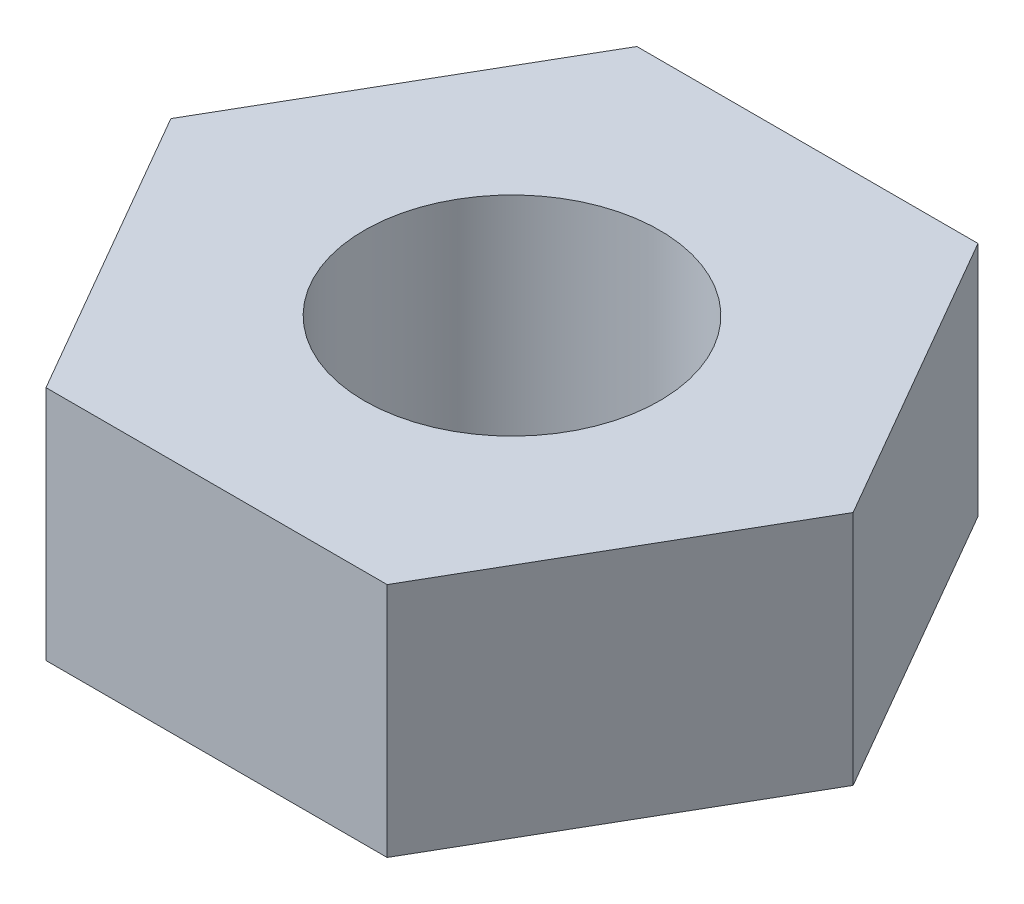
from build123d import *

# Parameters (mm, degrees)
BASE_EXTRUDE_DEPTH = 1.6
SKETCH2_R          = 1
CUT_EXTRUDE1_DEPTH = 4.448671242


with BuildPart() as part:
    # Sketch1 → Base-Extrude (new body)
    with BuildSketch(Plane(origin=(0, 0, 0), x_dir=(1, 0, 0), z_dir=(0, 1, 0))):
        Polygon((2.309401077, 0), (1.154700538, 2), (-1.154700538, 2), (-2.309401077, 0), (-1.154700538, -2), (1.154700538, -2), align=None)
    extrude(amount=BASE_EXTRUDE_DEPTH)

    # Sketch2 → Cut-Extrude1 (cut, through all)
    with BuildSketch(Plane(origin=(0, 1.6, 0), x_dir=(-1, 0, 0), z_dir=(0, 1, 0))):
        with Locations(Location((0, 0, 0), (0, 0, 90))):
            Circle(SKETCH2_R)
    extrude(amount=-CUT_EXTRUDE1_DEPTH, mode=Mode.SUBTRACT)


solid = part.part
